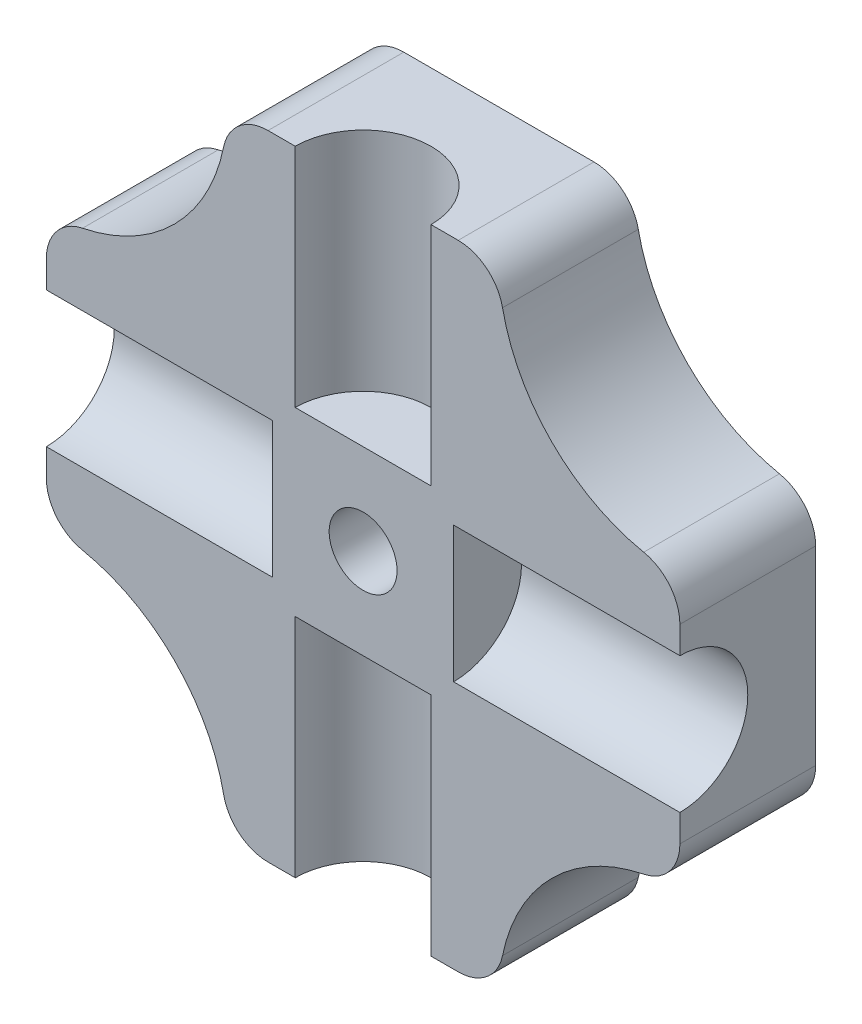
from build123d import *

# Parameters (mm, degrees)
ESQUISSE1_R                  = 1.5
EXTRUSION1_DEPTH             = 6
ESQUISSE2_R                  = 3
ENL_V_MAT_EXTRU_1_DEPTH      = 10
R_P_TITION_CIRCULAIRE1_COUNT = 4


with BuildPart() as part:
    # Esquisse1 → Extrusion1 (new body)
    with BuildSketch(Plane.XY):
        with BuildLine():
            Line((-4.202041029, 14), (4.202041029, 14))
            ThreePointArc((4.202041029, 14), (5.466952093, 13.549193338), (6.161632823, 12.4))
            ThreePointArc((6.161632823, 12.4), (8.343145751, 8.343145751), (12.4, 6.161632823))
            ThreePointArc((12.4, 6.161632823), (13.549193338, 5.466952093), (14, 4.202041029))
            Line((14, 4.202041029), (14, -4.202041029))
            ThreePointArc((14, -4.202041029), (13.549193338, -5.466952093), (12.4, -6.161632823))
            ThreePointArc((12.4, -6.161632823), (8.343145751, -8.343145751), (6.161632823, -12.4))
            ThreePointArc((6.161632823, -12.4), (5.466952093, -13.549193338), (4.202041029, -14))
            Line((4.202041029, -14), (-4.202041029, -14))
            ThreePointArc((-4.202041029, -14), (-5.466952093, -13.549193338), (-6.161632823, -12.4))
            ThreePointArc((-6.161632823, -12.4), (-8.343145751, -8.343145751), (-12.4, -6.161632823))
            ThreePointArc((-12.4, -6.161632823), (-13.549193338, -5.466952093), (-14, -4.202041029))
            Line((-14, -4.202041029), (-14, 4.202041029))
            ThreePointArc((-14, 4.202041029), (-13.549193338, 5.466952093), (-12.4, 6.161632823))
            ThreePointArc((-12.4, 6.161632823), (-8.343145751, 8.343145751), (-6.161632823, 12.4))
            ThreePointArc((-6.161632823, 12.4), (-5.466952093, 13.549193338), (-4.202041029, 14))
        make_face()
        Circle(ESQUISSE1_R, mode=Mode.SUBTRACT)
    extrude(amount=EXTRUSION1_DEPTH)

    # Esquisse2 → Enl_v. mat.-Extru.1 (cut)
    with BuildSketch(Plane(origin=(0, 14, 0), x_dir=(-1, 0, 0), z_dir=(0, 1, 0))):
        with Locations((0, 6)):
            Circle(ESQUISSE2_R)
    enl_v_mat_extru_1 = extrude(amount=-ENL_V_MAT_EXTRU_1_DEPTH, mode=Mode.SUBTRACT)

    # R_p_tition circulaire1: Enl_v. mat.-Extru.1 ×4 about axis
    r_p_tition_circulaire1_axis = Axis((0, 0, 0), (0, 0, 1))
    for i in range(1, R_P_TITION_CIRCULAIRE1_COUNT):
        add(enl_v_mat_extru_1.rotate(r_p_tition_circulaire1_axis, i * 360 / R_P_TITION_CIRCULAIRE1_COUNT), mode=Mode.SUBTRACT)


solid = part.part
